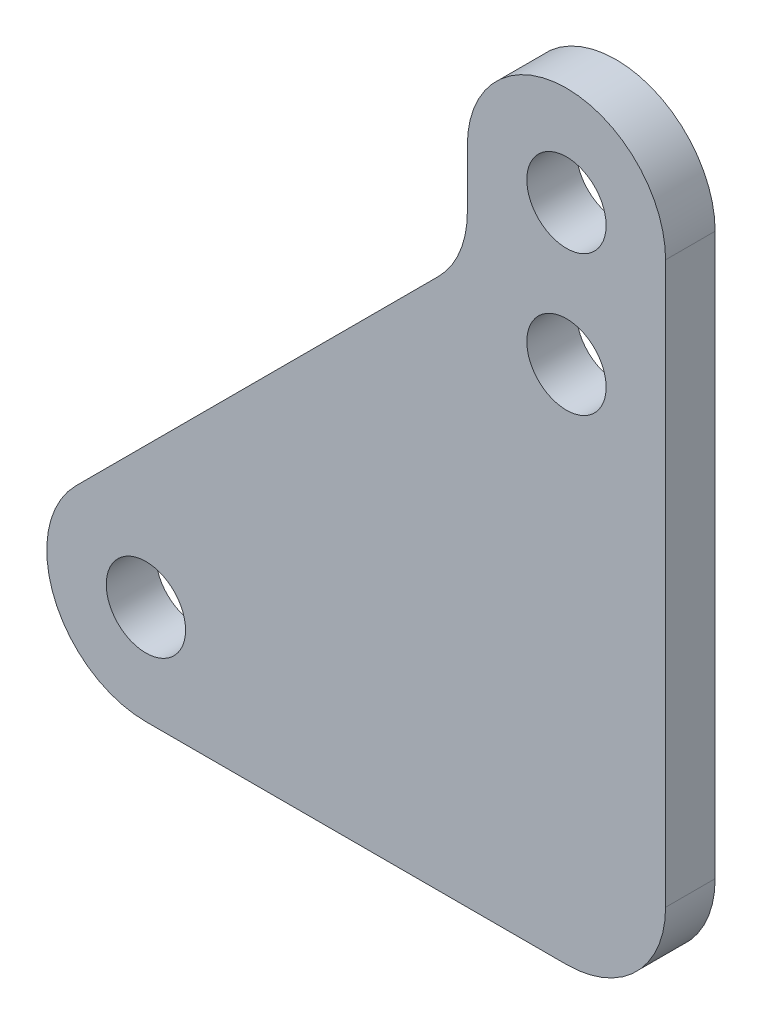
from build123d import *

# Parameters (mm, degrees)
SKETCH1_R           = 8
BOSS_EXTRUDE1_DEPTH = 10


with BuildPart() as part:
    # Sketch1 → Boss-Extrude1 (new body)
    with BuildSketch(Plane.XY):
        with BuildLine():
            Line((34.142135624, 34.142135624), (107.279220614, 107.279220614))
            ThreePointArc((107.279220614, 107.279220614), (111.61467564, 113.76768759), (113.13708499, 121.421356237))
            Line((113.13708499, 121.421356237), (113.13708499, 133.132813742))
            ThreePointArc((113.13708499, 133.132813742), (133.13708499, 153.132813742), (153.13708499, 133.132813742))
            Line((153.13708499, 133.132813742), (153.13708499, 20))
            ThreePointArc((153.13708499, 20), (147.279220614, 5.857864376), (133.13708499, 0))
            Line((133.13708499, 0), (48.284271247, 0))
            ThreePointArc((48.284271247, 0), (29.806680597, 12.346331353), (34.142135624, 34.142135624))
        make_face()
        with Locations((48.284271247, 20)):
            Circle(SKETCH1_R, mode=Mode.SUBTRACT)
        with Locations((133.13708499, 104.852813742)):
            Circle(SKETCH1_R, mode=Mode.SUBTRACT)
        with Locations((133.13708499, 133.132813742)):
            Circle(SKETCH1_R, mode=Mode.SUBTRACT)
    extrude(amount=BOSS_EXTRUDE1_DEPTH)


solid = part.part
